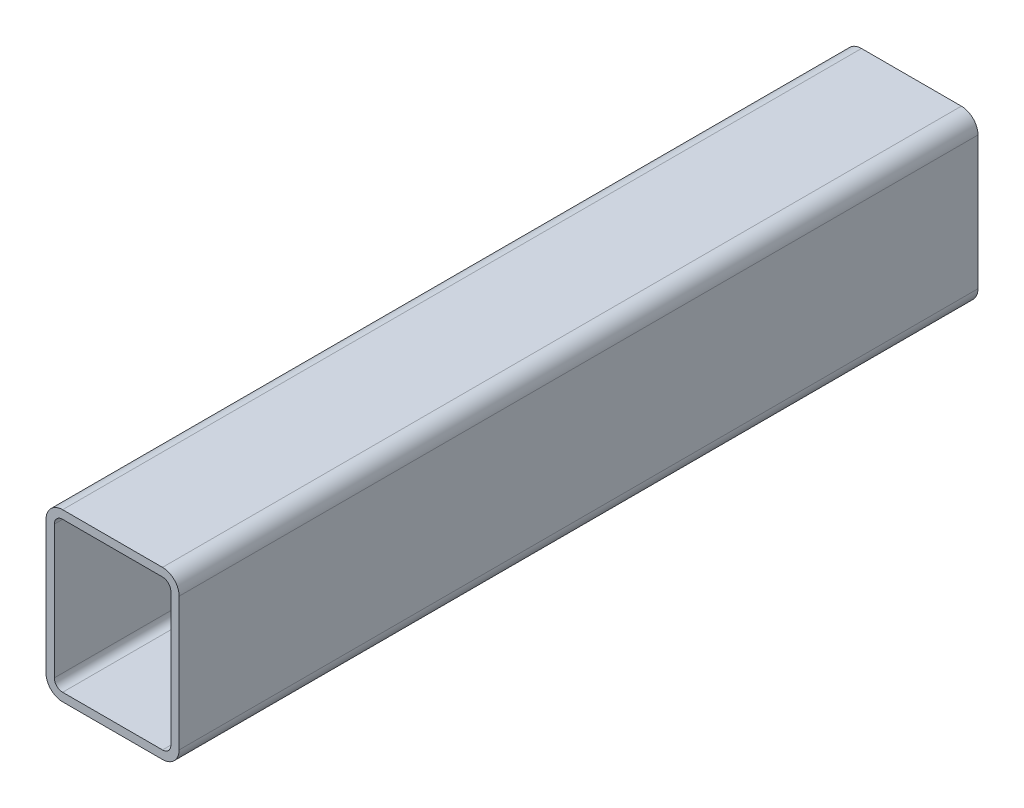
from build123d import *

# Parameters (mm, degrees)
BOSS_EXTRUDE1_DEPTH = 304.8


with BuildPart() as part:
    # Sketch1 → Boss-Extrude1 (new body)
    with BuildSketch(Plane.XY):
        with BuildLine():
            Line((6.35, 63.5), (44.45, 63.5))
            ThreePointArc((44.45, 63.5), (48.940128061, 61.640128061), (50.8, 57.15))
            Line((50.8, 57.15), (50.8, 6.35))
            ThreePointArc((50.8, 6.35), (48.940128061, 1.859871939), (44.45, 0))
            Line((44.45, 0), (6.35, 0))
            ThreePointArc((6.35, 0), (1.859871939, 1.859871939), (0, 6.35))
            Line((0, 6.35), (0, 57.15))
            ThreePointArc((0, 57.15), (1.859871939, 61.640128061), (6.35, 63.5))
        make_face()
        with BuildLine():
            Line((6.35, 60.325), (44.45, 60.325))
            ThreePointArc((44.45, 60.325), (46.69506403, 59.39506403), (47.625, 57.15))
            Line((47.625, 57.15), (47.625, 6.35))
            ThreePointArc((47.625, 6.35), (46.69506403, 4.10493597), (44.45, 3.175))
            Line((44.45, 3.175), (6.35, 3.175))
            ThreePointArc((6.35, 3.175), (4.10493597, 4.10493597), (3.175, 6.35))
            Line((3.175, 6.35), (3.175, 57.15))
            ThreePointArc((3.175, 57.15), (4.10493597, 59.39506403), (6.35, 60.325))
        make_face(mode=Mode.SUBTRACT)
    extrude(amount=BOSS_EXTRUDE1_DEPTH)


solid = part.part
